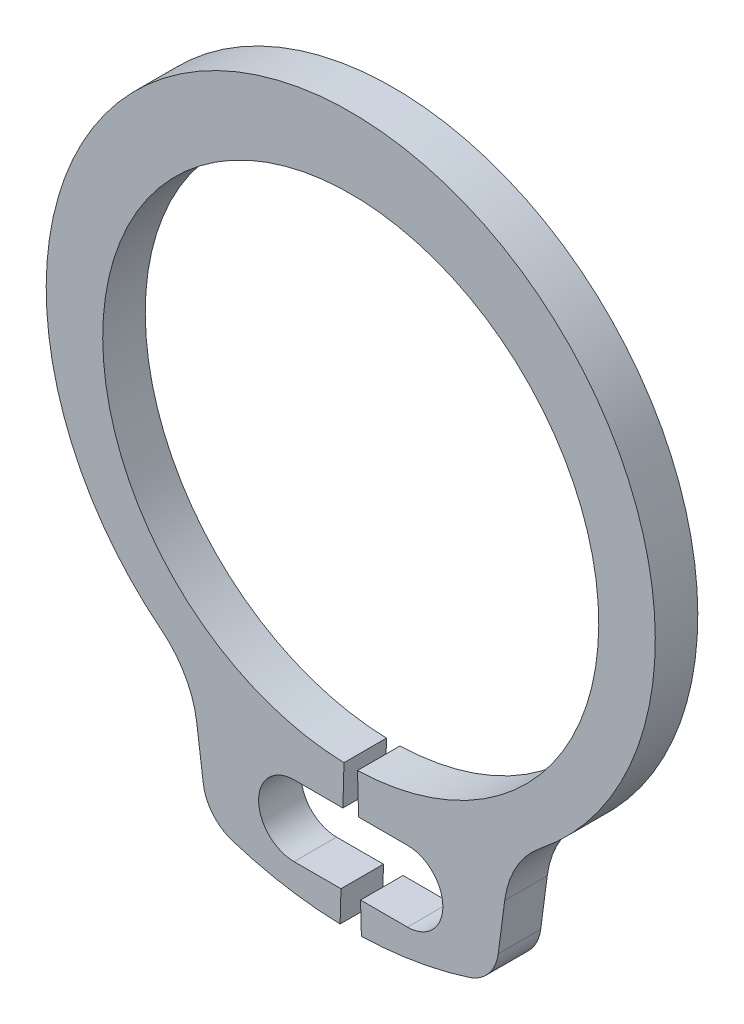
ISO-10303-21;
HEADER;
FILE_DESCRIPTION(('STEP AP214'),'2;1');
FILE_NAME('part.step','',(''),(''),'','','');
FILE_SCHEMA(('AUTOMOTIVE_DESIGN { 1 0 10303 214 1 1 1 1 }'));
ENDSEC;
DATA;
#1=APPLICATION_CONTEXT('core data for automotive mechanical design processes');
#2=APPLICATION_PROTOCOL_DEFINITION('international standard','automotive_design',2000,#1);
#3=PRODUCT_CONTEXT('',#1,'mechanical');
#4=PRODUCT('Part','Part','',(#3));
#5=PRODUCT_RELATED_PRODUCT_CATEGORY('part','',(#4));
#6=PRODUCT_DEFINITION_FORMATION('','',#4);
#7=PRODUCT_DEFINITION_CONTEXT('part definition',#1,'design');
#8=PRODUCT_DEFINITION('design','',#6,#7);
#9=PRODUCT_DEFINITION_SHAPE('','',#8);
#10=(LENGTH_UNIT() NAMED_UNIT(*) SI_UNIT(.MILLI.,.METRE.));
#11=(NAMED_UNIT(*) PLANE_ANGLE_UNIT() SI_UNIT($,.RADIAN.));
#12=(NAMED_UNIT(*) SI_UNIT($,.STERADIAN.) SOLID_ANGLE_UNIT());
#13=UNCERTAINTY_MEASURE_WITH_UNIT(LENGTH_MEASURE(1.E-05),#10,'distance_accuracy_value','');
#14=(GEOMETRIC_REPRESENTATION_CONTEXT(3) GLOBAL_UNCERTAINTY_ASSIGNED_CONTEXT((#13)) GLOBAL_UNIT_ASSIGNED_CONTEXT((#10,
#11,#12)) REPRESENTATION_CONTEXT('',''));
#15=CARTESIAN_POINT('',(0.,0.,0.));
#16=DIRECTION('',(0.,0.,1.));
#17=DIRECTION('',(1.,0.,0.));
#18=AXIS2_PLACEMENT_3D('',#15,#16,#17);
#19=CARTESIAN_POINT('',(-0.0606136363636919,-2.22167329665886,-0.381000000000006));
#20=DIRECTION('',(0.999628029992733,-0.0272727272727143,0.));
#21=DIRECTION('',(0.0272727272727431,0.999628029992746,0.));
#22=AXIS2_PLACEMENT_3D('',#19,#20,#21);
#23=PLANE('',#22);
#24=DIRECTION('',(0.,0.,1.));
#25=VECTOR('',#24,1.);
#26=CARTESIAN_POINT('',(-0.0703442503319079,-2.57832976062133,-0.381000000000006));
#27=LINE('',#26,#25);
#28=CARTESIAN_POINT('',(-0.0703442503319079,-2.57832976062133,-0.381000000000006));
#29=VERTEX_POINT('',#28);
#30=CARTESIAN_POINT('',(-0.0703442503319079,-2.57832976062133,0.));
#31=VERTEX_POINT('',#30);
#32=EDGE_CURVE('E193',#29,#31,#27,.T.);
#33=ORIENTED_EDGE('',*,*,#32,.F.);
#34=DIRECTION('',(0.027272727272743,0.999628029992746,0.));
#35=VECTOR('',#34,1.);
#36=CARTESIAN_POINT('',(-0.0606136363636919,-2.22167329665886,-0.381000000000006));
#37=LINE('',#36,#35);
#38=CARTESIAN_POINT('',(-0.0606136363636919,-2.22167329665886,-0.381000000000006));
#39=VERTEX_POINT('',#38);
#40=EDGE_CURVE('E275',#29,#39,#37,.T.);
#41=ORIENTED_EDGE('',*,*,#40,.T.);
#42=DIRECTION('',(0.,0.,1.));
#43=VECTOR('',#42,1.);
#44=CARTESIAN_POINT('',(-0.0606136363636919,-2.22167329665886,-0.381000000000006));
#45=LINE('',#44,#43);
#46=CARTESIAN_POINT('',(-0.0606136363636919,-2.22167329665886,0.));
#47=VERTEX_POINT('',#46);
#48=EDGE_CURVE('E11',#39,#47,#45,.T.);
#49=ORIENTED_EDGE('',*,*,#48,.T.);
#50=DIRECTION('',(0.027272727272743,0.999628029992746,0.));
#51=VECTOR('',#50,1.);
#52=CARTESIAN_POINT('',(-0.0606136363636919,-2.22167329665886,0.));
#53=LINE('',#52,#51);
#54=EDGE_CURVE('E239',#31,#47,#53,.T.);
#55=ORIENTED_EDGE('',*,*,#54,.F.);
#56=EDGE_LOOP('',(#33,#41,#49,#55));
#57=FACE_BOUND('',#56,.T.);
#58=ADVANCED_FACE('F26',(#57),#23,.T.);
#59=CARTESIAN_POINT('',(0.0606136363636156,-2.22167329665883,-0.381000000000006));
#60=DIRECTION('',(-0.999628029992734,-0.0272727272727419,0.));
#61=DIRECTION('',(0.0272727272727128,-0.999628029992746,0.));
#62=AXIS2_PLACEMENT_3D('',#59,#60,#61);
#63=PLANE('',#62);
#64=DIRECTION('',(0.,0.,-1.));
#65=VECTOR('',#64,1.);
#66=CARTESIAN_POINT('',(0.0703442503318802,-2.57832976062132,-0.381000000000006));
#67=LINE('',#66,#65);
#68=CARTESIAN_POINT('',(0.0703442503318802,-2.57832976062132,0.));
#69=VERTEX_POINT('',#68);
#70=CARTESIAN_POINT('',(0.0703442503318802,-2.57832976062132,-0.381000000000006));
#71=VERTEX_POINT('',#70);
#72=EDGE_CURVE('E197',#69,#71,#67,.T.);
#73=ORIENTED_EDGE('',*,*,#72,.F.);
#74=DIRECTION('',(0.0272727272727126,-0.999628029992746,0.));
#75=VECTOR('',#74,1.);
#76=CARTESIAN_POINT('',(0.0606136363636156,-2.22167329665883,0.));
#77=LINE('',#76,#75);
#78=CARTESIAN_POINT('',(0.0606136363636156,-2.22167329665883,0.));
#79=VERTEX_POINT('',#78);
#80=EDGE_CURVE('E210',#79,#69,#77,.T.);
#81=ORIENTED_EDGE('',*,*,#80,.F.);
#82=DIRECTION('',(0.,0.,1.));
#83=VECTOR('',#82,1.);
#84=CARTESIAN_POINT('',(0.0606136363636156,-2.22167329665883,-0.381000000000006));
#85=LINE('',#84,#83);
#86=CARTESIAN_POINT('',(0.0606136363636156,-2.22167329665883,-0.381000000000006));
#87=VERTEX_POINT('',#86);
#88=EDGE_CURVE('E30',#87,#79,#85,.T.);
#89=ORIENTED_EDGE('',*,*,#88,.F.);
#90=DIRECTION('',(0.0272727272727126,-0.999628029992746,0.));
#91=VECTOR('',#90,1.);
#92=CARTESIAN_POINT('',(0.0606136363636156,-2.22167329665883,-0.381000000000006));
#93=LINE('',#92,#91);
#94=EDGE_CURVE('E245',#87,#71,#93,.T.);
#95=ORIENTED_EDGE('',*,*,#94,.T.);
#96=EDGE_LOOP('',(#73,#81,#89,#95));
#97=FACE_BOUND('',#96,.T.);
#98=ADVANCED_FACE('F309',(#97),#63,.T.);
#99=CARTESIAN_POINT('',(0.,0.,-0.381000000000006));
#100=DIRECTION('',(0.,0.,1.));
#101=DIRECTION('',(1.00000000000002,0.,0.));
#102=AXIS2_PLACEMENT_3D('',#99,#100,#101);
#103=CYLINDRICAL_SURFACE('',#102,2.2225);
#104=CARTESIAN_POINT('',(0.,0.,0.));
#105=DIRECTION('',(0.,0.,-1.));
#106=DIRECTION('',(1.00000000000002,0.,0.));
#107=AXIS2_PLACEMENT_3D('',#104,#105,#106);
#108=CIRCLE('',#107,2.2225);
#109=EDGE_CURVE('E206',#47,#79,#108,.T.);
#110=ORIENTED_EDGE('',*,*,#109,.F.);
#111=ORIENTED_EDGE('',*,*,#48,.F.);
#112=CARTESIAN_POINT('',(0.,0.,-0.381000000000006));
#113=DIRECTION('',(0.,0.,-1.));
#114=DIRECTION('',(1.00000000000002,0.,0.));
#115=AXIS2_PLACEMENT_3D('',#112,#113,#114);
#116=CIRCLE('',#115,2.2225);
#117=EDGE_CURVE('E241',#39,#87,#116,.T.);
#118=ORIENTED_EDGE('',*,*,#117,.T.);
#119=ORIENTED_EDGE('',*,*,#88,.T.);
#120=EDGE_LOOP('',(#110,#111,#118,#119));
#121=FACE_BOUND('',#120,.T.);
#122=ADVANCED_FACE('F28',(#121),#103,.F.);
#123=DIRECTION('',(0.,0.,-1.));
#124=VECTOR('',#123,1.);
#125=CARTESIAN_POINT('',(-0.0876688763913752,-3.21332976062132,-0.381000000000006));
#126=LINE('',#125,#124);
#127=CARTESIAN_POINT('',(-0.0876688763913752,-3.21332976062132,0.));
#128=VERTEX_POINT('',#127);
#129=CARTESIAN_POINT('',(-0.0876688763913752,-3.21332976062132,-0.381000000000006));
#130=VERTEX_POINT('',#129);
#131=EDGE_CURVE('E331',#128,#130,#126,.T.);
#132=ORIENTED_EDGE('',*,*,#131,.F.);
#133=CARTESIAN_POINT('',(-0.0952499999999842,-3.49120089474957,0.));
#134=VERTEX_POINT('',#133);
#135=EDGE_CURVE('E187',#134,#128,#53,.T.);
#136=ORIENTED_EDGE('',*,*,#135,.F.);
#137=DIRECTION('',(0.,0.,1.));
#138=VECTOR('',#137,1.);
#139=CARTESIAN_POINT('',(-0.0952499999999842,-3.49120089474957,-0.381000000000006));
#140=LINE('',#139,#138);
#141=CARTESIAN_POINT('',(-0.0952499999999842,-3.49120089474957,-0.381000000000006));
#142=VERTEX_POINT('',#141);
#143=EDGE_CURVE('E35',#142,#134,#140,.T.);
#144=ORIENTED_EDGE('',*,*,#143,.F.);
#145=EDGE_CURVE('E276',#142,#130,#37,.T.);
#146=ORIENTED_EDGE('',*,*,#145,.T.);
#147=EDGE_LOOP('',(#132,#136,#144,#146));
#148=FACE_BOUND('',#147,.T.);
#149=ADVANCED_FACE('F340',(#148),#23,.T.);
#150=CARTESIAN_POINT('',(0.,0.,-0.381000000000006));
#151=DIRECTION('',(0.,0.,1.));
#152=DIRECTION('',(1.00000000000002,0.,0.));
#153=AXIS2_PLACEMENT_3D('',#150,#151,#152);
#154=CYLINDRICAL_SURFACE('',#153,3.4925);
#155=CARTESIAN_POINT('',(0.,0.,0.));
#156=DIRECTION('',(0.,0.,1.));
#157=DIRECTION('',(1.00000000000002,0.,0.));
#158=AXIS2_PLACEMENT_3D('',#155,#156,#157);
#159=CIRCLE('',#158,3.4925);
#160=CARTESIAN_POINT('',(-1.05894131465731,-3.3280924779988,0.));
#161=VERTEX_POINT('',#160);
#162=EDGE_CURVE('E237',#161,#134,#159,.T.);
#163=ORIENTED_EDGE('',*,*,#162,.F.);
#164=DIRECTION('',(0.,0.,1.));
#165=VECTOR('',#164,1.);
#166=CARTESIAN_POINT('',(-1.05894131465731,-3.3280924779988,-0.381000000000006));
#167=LINE('',#166,#165);
#168=CARTESIAN_POINT('',(-1.05894131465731,-3.3280924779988,-0.381000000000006));
#169=VERTEX_POINT('',#168);
#170=EDGE_CURVE('E280',#169,#161,#167,.T.);
#171=ORIENTED_EDGE('',*,*,#170,.F.);
#172=CARTESIAN_POINT('',(0.,0.,-0.381000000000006));
#173=DIRECTION('',(0.,0.,1.));
#174=DIRECTION('',(1.00000000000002,0.,0.));
#175=AXIS2_PLACEMENT_3D('',#172,#173,#174);
#176=CIRCLE('',#175,3.4925);
#177=EDGE_CURVE('E272',#169,#142,#176,.T.);
#178=ORIENTED_EDGE('',*,*,#177,.T.);
#179=ORIENTED_EDGE('',*,*,#143,.T.);
#180=EDGE_LOOP('',(#163,#171,#178,#179));
#181=FACE_BOUND('',#180,.T.);
#182=ADVANCED_FACE('F343',(#181),#154,.T.);
#183=CARTESIAN_POINT('',(-0.94342044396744,-2.96502784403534,-0.381000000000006));
#184=DIRECTION('',(0.,0.,1.));
#185=DIRECTION('',(1.00000000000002,0.,0.));
#186=AXIS2_PLACEMENT_3D('',#183,#184,#185);
#187=CYLINDRICAL_SURFACE('',#186,0.381);
#188=CARTESIAN_POINT('',(-0.94342044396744,-2.96502784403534,0.));
#189=DIRECTION('',(0.,0.,1.));
#190=DIRECTION('',(1.00000000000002,0.,0.));
#191=AXIS2_PLACEMENT_3D('',#188,#189,#190);
#192=CIRCLE('',#191,0.381);
#193=CARTESIAN_POINT('',(-1.32116093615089,-3.01475832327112,0.));
#194=VERTEX_POINT('',#193);
#195=EDGE_CURVE('E234',#194,#161,#192,.T.);
#196=ORIENTED_EDGE('',*,*,#195,.F.);
#197=DIRECTION('',(0.,0.,1.));
#198=VECTOR('',#197,1.);
#199=CARTESIAN_POINT('',(-1.32116093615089,-3.01475832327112,-0.381000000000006));
#200=LINE('',#199,#198);
#201=CARTESIAN_POINT('',(-1.32116093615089,-3.01475832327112,-0.381000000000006));
#202=VERTEX_POINT('',#201);
#203=EDGE_CURVE('E282',#202,#194,#200,.T.);
#204=ORIENTED_EDGE('',*,*,#203,.F.);
#205=CARTESIAN_POINT('',(-0.94342044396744,-2.96502784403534,-0.381000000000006));
#206=DIRECTION('',(0.,0.,1.));
#207=DIRECTION('',(1.00000000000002,0.,0.));
#208=AXIS2_PLACEMENT_3D('',#205,#206,#207);
#209=CIRCLE('',#208,0.381);
#210=EDGE_CURVE('E269',#202,#169,#209,.T.);
#211=ORIENTED_EDGE('',*,*,#210,.T.);
#212=ORIENTED_EDGE('',*,*,#170,.T.);
#213=EDGE_LOOP('',(#196,#204,#211,#212));
#214=FACE_BOUND('',#213,.T.);
#215=ADVANCED_FACE('F348',(#214),#187,.T.);
#216=CARTESIAN_POINT('',(-1.37963945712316,-2.57056985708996,-0.381000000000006));
#217=DIRECTION('',(-0.991444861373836,-0.130526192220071,0.));
#218=DIRECTION('',(0.130526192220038,-0.991444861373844,0.));
#219=AXIS2_PLACEMENT_3D('',#216,#217,#218);
#220=PLANE('',#219);
#221=DIRECTION('',(0.130526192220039,-0.991444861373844,0.));
#222=VECTOR('',#221,1.);
#223=CARTESIAN_POINT('',(-1.37963945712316,-2.57056985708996,0.));
#224=LINE('',#223,#222);
#225=CARTESIAN_POINT('',(-1.37963945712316,-2.57056985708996,0.));
#226=VERTEX_POINT('',#225);
#227=EDGE_CURVE('E231',#226,#194,#224,.T.);
#228=ORIENTED_EDGE('',*,*,#227,.F.);
#229=DIRECTION('',(0.,0.,1.));
#230=VECTOR('',#229,1.);
#231=CARTESIAN_POINT('',(-1.37963945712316,-2.57056985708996,-0.381000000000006));
#232=LINE('',#231,#230);
#233=CARTESIAN_POINT('',(-1.37963945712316,-2.57056985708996,-0.381000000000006));
#234=VERTEX_POINT('',#233);
#235=EDGE_CURVE('E284',#234,#226,#232,.T.);
#236=ORIENTED_EDGE('',*,*,#235,.F.);
#237=DIRECTION('',(0.130526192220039,-0.991444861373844,0.));
#238=VECTOR('',#237,1.);
#239=CARTESIAN_POINT('',(-1.37963945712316,-2.57056985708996,-0.381000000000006));
#240=LINE('',#239,#238);
#241=EDGE_CURVE('E266',#234,#202,#240,.T.);
#242=ORIENTED_EDGE('',*,*,#241,.T.);
#243=ORIENTED_EDGE('',*,*,#203,.T.);
#244=EDGE_LOOP('',(#228,#236,#242,#243));
#245=FACE_BOUND('',#244,.T.);
#246=ADVANCED_FACE('F351',(#245),#220,.T.);
#247=CARTESIAN_POINT('',(-2.23555537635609,-2.68325332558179,-0.381000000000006));
#248=DIRECTION('',(0.,0.,1.));
#249=DIRECTION('',(1.00000000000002,0.,0.));
#250=AXIS2_PLACEMENT_3D('',#247,#248,#249);
#251=CYLINDRICAL_SURFACE('',#250,0.863301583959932);
#252=CARTESIAN_POINT('',(-2.23555537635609,-2.68325332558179,0.));
#253=DIRECTION('',(0.,0.,-1.));
#254=DIRECTION('',(1.00000000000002,0.,0.));
#255=AXIS2_PLACEMENT_3D('',#252,#253,#254);
#256=CIRCLE('',#255,0.863301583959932);
#257=CARTESIAN_POINT('',(-1.69829563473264,-2.00750071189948,0.));
#258=VERTEX_POINT('',#257);
#259=EDGE_CURVE('E228',#258,#226,#256,.T.);
#260=ORIENTED_EDGE('',*,*,#259,.F.);
#261=DIRECTION('',(0.,0.,1.));
#262=VECTOR('',#261,1.);
#263=CARTESIAN_POINT('',(-1.69829563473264,-2.00750071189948,-0.381000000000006));
#264=LINE('',#263,#262);
#265=CARTESIAN_POINT('',(-1.69829563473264,-2.00750071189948,-0.381000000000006));
#266=VERTEX_POINT('',#265);
#267=EDGE_CURVE('E286',#266,#258,#264,.T.);
#268=ORIENTED_EDGE('',*,*,#267,.F.);
#269=CARTESIAN_POINT('',(-2.23555537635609,-2.68325332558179,-0.381000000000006));
#270=DIRECTION('',(0.,0.,-1.));
#271=DIRECTION('',(1.00000000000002,0.,0.));
#272=AXIS2_PLACEMENT_3D('',#269,#270,#271);
#273=CIRCLE('',#272,0.863301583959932);
#274=EDGE_CURVE('E263',#266,#234,#273,.T.);
#275=ORIENTED_EDGE('',*,*,#274,.T.);
#276=ORIENTED_EDGE('',*,*,#235,.T.);
#277=EDGE_LOOP('',(#260,#268,#275,#276));
#278=FACE_BOUND('',#277,.T.);
#279=ADVANCED_FACE('F356',(#278),#251,.F.);
#280=CARTESIAN_POINT('',(0.,0.128575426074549,-0.381000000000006));
#281=DIRECTION('',(0.,0.,1.));
#282=DIRECTION('',(1.00000000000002,0.,0.));
#283=AXIS2_PLACEMENT_3D('',#280,#281,#282);
#284=CYLINDRICAL_SURFACE('',#283,2.72892457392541);
#285=CARTESIAN_POINT('',(0.,0.128575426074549,0.));
#286=DIRECTION('',(0.,0.,1.));
#287=DIRECTION('',(1.00000000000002,0.,0.));
#288=AXIS2_PLACEMENT_3D('',#285,#286,#287);
#289=CIRCLE('',#288,2.72892457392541);
#290=CARTESIAN_POINT('',(1.69829563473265,-2.00750071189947,0.));
#291=VERTEX_POINT('',#290);
#292=EDGE_CURVE('E225',#291,#258,#289,.T.);
#293=ORIENTED_EDGE('',*,*,#292,.F.);
#294=DIRECTION('',(0.,0.,1.));
#295=VECTOR('',#294,1.);
#296=CARTESIAN_POINT('',(1.69829563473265,-2.00750071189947,-0.381000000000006));
#297=LINE('',#296,#295);
#298=CARTESIAN_POINT('',(1.69829563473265,-2.00750071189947,-0.381000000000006));
#299=VERTEX_POINT('',#298);
#300=EDGE_CURVE('E288',#299,#291,#297,.T.);
#301=ORIENTED_EDGE('',*,*,#300,.F.);
#302=CARTESIAN_POINT('',(0.,0.128575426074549,-0.381000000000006));
#303=DIRECTION('',(0.,0.,1.));
#304=DIRECTION('',(1.00000000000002,0.,0.));
#305=AXIS2_PLACEMENT_3D('',#302,#303,#304);
#306=CIRCLE('',#305,2.72892457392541);
#307=EDGE_CURVE('E260',#299,#266,#306,.T.);
#308=ORIENTED_EDGE('',*,*,#307,.T.);
#309=ORIENTED_EDGE('',*,*,#267,.T.);
#310=EDGE_LOOP('',(#293,#301,#308,#309));
#311=FACE_BOUND('',#310,.T.);
#312=ADVANCED_FACE('F359',(#311),#284,.T.);
#313=CARTESIAN_POINT('',(2.23555537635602,-2.6832533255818,-0.381000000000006));
#314=DIRECTION('',(0.,0.,1.));
#315=DIRECTION('',(1.00000000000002,0.,0.));
#316=AXIS2_PLACEMENT_3D('',#313,#314,#315);
#317=CYLINDRICAL_SURFACE('',#316,0.863301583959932);
#318=CARTESIAN_POINT('',(2.23555537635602,-2.6832533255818,0.));
#319=DIRECTION('',(0.,0.,-1.));
#320=DIRECTION('',(1.00000000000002,0.,0.));
#321=AXIS2_PLACEMENT_3D('',#318,#319,#320);
#322=CIRCLE('',#321,0.863301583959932);
#323=CARTESIAN_POINT('',(1.37963945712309,-2.57056985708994,0.));
#324=VERTEX_POINT('',#323);
#325=EDGE_CURVE('E222',#324,#291,#322,.T.);
#326=ORIENTED_EDGE('',*,*,#325,.F.);
#327=DIRECTION('',(0.,0.,1.));
#328=VECTOR('',#327,1.);
#329=CARTESIAN_POINT('',(1.37963945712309,-2.57056985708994,-0.381000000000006));
#330=LINE('',#329,#328);
#331=CARTESIAN_POINT('',(1.37963945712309,-2.57056985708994,-0.381000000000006));
#332=VERTEX_POINT('',#331);
#333=EDGE_CURVE('E290',#332,#324,#330,.T.);
#334=ORIENTED_EDGE('',*,*,#333,.F.);
#335=CARTESIAN_POINT('',(2.23555537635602,-2.6832533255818,-0.381000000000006));
#336=DIRECTION('',(0.,0.,-1.));
#337=DIRECTION('',(1.00000000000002,0.,0.));
#338=AXIS2_PLACEMENT_3D('',#335,#336,#337);
#339=CIRCLE('',#338,0.863301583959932);
#340=EDGE_CURVE('E257',#332,#299,#339,.T.);
#341=ORIENTED_EDGE('',*,*,#340,.T.);
#342=ORIENTED_EDGE('',*,*,#300,.T.);
#343=EDGE_LOOP('',(#326,#334,#341,#342));
#344=FACE_BOUND('',#343,.T.);
#345=ADVANCED_FACE('F364',(#344),#317,.F.);
#346=CARTESIAN_POINT('',(1.37963945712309,-2.57056985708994,-0.381000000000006));
#347=DIRECTION('',(0.991444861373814,-0.13052619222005,0.));
#348=DIRECTION('',(0.130526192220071,0.991444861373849,0.));
#349=AXIS2_PLACEMENT_3D('',#346,#347,#348);
#350=PLANE('',#349);
#351=DIRECTION('',(0.130526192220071,0.991444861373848,0.));
#352=VECTOR('',#351,1.);
#353=CARTESIAN_POINT('',(1.37963945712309,-2.57056985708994,0.));
#354=LINE('',#353,#352);
#355=CARTESIAN_POINT('',(1.32116093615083,-3.01475832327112,0.));
#356=VERTEX_POINT('',#355);
#357=EDGE_CURVE('E219',#356,#324,#354,.T.);
#358=ORIENTED_EDGE('',*,*,#357,.F.);
#359=DIRECTION('',(0.,0.,1.));
#360=VECTOR('',#359,1.);
#361=CARTESIAN_POINT('',(1.32116093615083,-3.01475832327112,-0.381000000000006));
#362=LINE('',#361,#360);
#363=CARTESIAN_POINT('',(1.32116093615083,-3.01475832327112,-0.381000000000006));
#364=VERTEX_POINT('',#363);
#365=EDGE_CURVE('E292',#364,#356,#362,.T.);
#366=ORIENTED_EDGE('',*,*,#365,.F.);
#367=DIRECTION('',(0.130526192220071,0.991444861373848,0.));
#368=VECTOR('',#367,1.);
#369=CARTESIAN_POINT('',(1.37963945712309,-2.57056985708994,-0.381000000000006));
#370=LINE('',#369,#368);
#371=EDGE_CURVE('E254',#364,#332,#370,.T.);
#372=ORIENTED_EDGE('',*,*,#371,.T.);
#373=ORIENTED_EDGE('',*,*,#333,.T.);
#374=EDGE_LOOP('',(#358,#366,#372,#373));
#375=FACE_BOUND('',#374,.T.);
#376=ADVANCED_FACE('F367',(#375),#350,.T.);
#377=CARTESIAN_POINT('',(0.94342044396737,-2.96502784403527,-0.381000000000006));
#378=DIRECTION('',(0.,0.,1.));
#379=DIRECTION('',(1.00000000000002,0.,0.));
#380=AXIS2_PLACEMENT_3D('',#377,#378,#379);
#381=CYLINDRICAL_SURFACE('',#380,0.381);
#382=CARTESIAN_POINT('',(0.94342044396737,-2.96502784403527,0.));
#383=DIRECTION('',(0.,0.,1.));
#384=DIRECTION('',(-1.00000000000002,0.,0.));
#385=AXIS2_PLACEMENT_3D('',#382,#383,#384);
#386=CIRCLE('',#385,0.381);
#387=CARTESIAN_POINT('',(1.05894131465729,-3.32809247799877,0.));
#388=VERTEX_POINT('',#387);
#389=EDGE_CURVE('E216',#388,#356,#386,.T.);
#390=ORIENTED_EDGE('',*,*,#389,.F.);
#391=DIRECTION('',(0.,0.,1.));
#392=VECTOR('',#391,1.);
#393=CARTESIAN_POINT('',(1.05894131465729,-3.32809247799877,-0.381000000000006));
#394=LINE('',#393,#392);
#395=CARTESIAN_POINT('',(1.05894131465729,-3.32809247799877,-0.381000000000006));
#396=VERTEX_POINT('',#395);
#397=EDGE_CURVE('E294',#396,#388,#394,.T.);
#398=ORIENTED_EDGE('',*,*,#397,.F.);
#399=CARTESIAN_POINT('',(0.94342044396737,-2.96502784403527,-0.381000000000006));
#400=DIRECTION('',(0.,0.,1.));
#401=DIRECTION('',(-1.00000000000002,0.,0.));
#402=AXIS2_PLACEMENT_3D('',#399,#400,#401);
#403=CIRCLE('',#402,0.381);
#404=EDGE_CURVE('E251',#396,#364,#403,.T.);
#405=ORIENTED_EDGE('',*,*,#404,.T.);
#406=ORIENTED_EDGE('',*,*,#365,.T.);
#407=EDGE_LOOP('',(#390,#398,#405,#406));
#408=FACE_BOUND('',#407,.T.);
#409=ADVANCED_FACE('F372',(#408),#381,.T.);
#410=CARTESIAN_POINT('',(0.,0.,-0.381000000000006));
#411=DIRECTION('',(0.,0.,1.));
#412=DIRECTION('',(1.00000000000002,0.,0.));
#413=AXIS2_PLACEMENT_3D('',#410,#411,#412);
#414=CYLINDRICAL_SURFACE('',#413,3.4925);
#415=CARTESIAN_POINT('',(0.,0.,0.));
#416=DIRECTION('',(0.,0.,1.));
#417=DIRECTION('',(1.00000000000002,0.,0.));
#418=AXIS2_PLACEMENT_3D('',#415,#416,#417);
#419=CIRCLE('',#418,3.4925);
#420=CARTESIAN_POINT('',(0.0952500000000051,-3.49120089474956,0.));
#421=VERTEX_POINT('',#420);
#422=EDGE_CURVE('E213',#421,#388,#419,.T.);
#423=ORIENTED_EDGE('',*,*,#422,.F.);
#424=DIRECTION('',(0.,0.,1.));
#425=VECTOR('',#424,1.);
#426=CARTESIAN_POINT('',(0.0952500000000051,-3.49120089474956,-0.381000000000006));
#427=LINE('',#426,#425);
#428=CARTESIAN_POINT('',(0.0952500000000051,-3.49120089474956,-0.381000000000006));
#429=VERTEX_POINT('',#428);
#430=EDGE_CURVE('E295',#429,#421,#427,.T.);
#431=ORIENTED_EDGE('',*,*,#430,.F.);
#432=CARTESIAN_POINT('',(0.,0.,-0.381000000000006));
#433=DIRECTION('',(0.,0.,1.));
#434=DIRECTION('',(1.00000000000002,0.,0.));
#435=AXIS2_PLACEMENT_3D('',#432,#433,#434);
#436=CIRCLE('',#435,3.4925);
#437=EDGE_CURVE('E248',#429,#396,#436,.T.);
#438=ORIENTED_EDGE('',*,*,#437,.T.);
#439=ORIENTED_EDGE('',*,*,#397,.T.);
#440=EDGE_LOOP('',(#423,#431,#438,#439));
#441=FACE_BOUND('',#440,.T.);
#442=ADVANCED_FACE('F374',(#441),#414,.T.);
#443=DIRECTION('',(0.,0.,1.));
#444=VECTOR('',#443,1.);
#445=CARTESIAN_POINT('',(0.0876688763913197,-3.21332976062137,-0.381000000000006));
#446=LINE('',#445,#444);
#447=CARTESIAN_POINT('',(0.0876688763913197,-3.21332976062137,-0.381000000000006));
#448=VERTEX_POINT('',#447);
#449=CARTESIAN_POINT('',(0.0876688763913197,-3.21332976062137,0.));
#450=VERTEX_POINT('',#449);
#451=EDGE_CURVE('E327',#448,#450,#446,.T.);
#452=ORIENTED_EDGE('',*,*,#451,.F.);
#453=EDGE_CURVE('E244',#448,#429,#93,.T.);
#454=ORIENTED_EDGE('',*,*,#453,.T.);
#455=ORIENTED_EDGE('',*,*,#430,.T.);
#456=EDGE_CURVE('E209',#450,#421,#77,.T.);
#457=ORIENTED_EDGE('',*,*,#456,.F.);
#458=EDGE_LOOP('',(#452,#454,#455,#457));
#459=FACE_BOUND('',#458,.T.);
#460=ADVANCED_FACE('F377',(#459),#63,.T.);
#461=CARTESIAN_POINT('',(0.,0.,-0.381000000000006));
#462=DIRECTION('',(0.,0.,1.));
#463=DIRECTION('',(1.00000000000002,0.,0.));
#464=AXIS2_PLACEMENT_3D('',#461,#462,#463);
#465=PLANE('',#464);
#466=CARTESIAN_POINT('',(0.507999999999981,-2.89582976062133,-0.381000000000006));
#467=DIRECTION('',(0.,0.,1.));
#468=DIRECTION('',(1.00000000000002,0.,0.));
#469=AXIS2_PLACEMENT_3D('',#466,#467,#468);
#470=CIRCLE('',#469,0.3175);
#471=CARTESIAN_POINT('',(0.50799999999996,-3.21332976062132,-0.381000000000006));
#472=VERTEX_POINT('',#471);
#473=CARTESIAN_POINT('',(0.507999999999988,-2.57832976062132,-0.381000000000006));
#474=VERTEX_POINT('',#473);
#475=EDGE_CURVE('E203',#472,#474,#470,.T.);
#476=ORIENTED_EDGE('',*,*,#475,.T.);
#477=DIRECTION('',(-1.00000000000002,0.,0.));
#478=VECTOR('',#477,1.);
#479=CARTESIAN_POINT('',(-0.508000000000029,-2.57832976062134,-0.381000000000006));
#480=LINE('',#479,#478);
#481=EDGE_CURVE('E51',#474,#71,#480,.T.);
#482=ORIENTED_EDGE('',*,*,#481,.T.);
#483=ORIENTED_EDGE('',*,*,#94,.F.);
#484=ORIENTED_EDGE('',*,*,#117,.F.);
#485=ORIENTED_EDGE('',*,*,#40,.F.);
#486=CARTESIAN_POINT('',(-0.508000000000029,-2.57832976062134,-0.381000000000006));
#487=VERTEX_POINT('',#486);
#488=EDGE_CURVE('E188',#29,#487,#480,.T.);
#489=ORIENTED_EDGE('',*,*,#488,.T.);
#490=CARTESIAN_POINT('',(-0.508000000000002,-2.89582976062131,-0.381000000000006));
#491=DIRECTION('',(0.,0.,1.));
#492=DIRECTION('',(1.00000000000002,0.,0.));
#493=AXIS2_PLACEMENT_3D('',#490,#491,#492);
#494=CIRCLE('',#493,0.3175);
#495=CARTESIAN_POINT('',(-0.507999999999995,-3.21332976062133,-0.381000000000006));
#496=VERTEX_POINT('',#495);
#497=EDGE_CURVE('E192',#487,#496,#494,.T.);
#498=ORIENTED_EDGE('',*,*,#497,.T.);
#499=DIRECTION('',(1.00000000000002,0.,0.));
#500=VECTOR('',#499,1.);
#501=CARTESIAN_POINT('',(0.50799999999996,-3.21332976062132,-0.381000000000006));
#502=LINE('',#501,#500);
#503=EDGE_CURVE('E170',#496,#130,#502,.T.);
#504=ORIENTED_EDGE('',*,*,#503,.T.);
#505=ORIENTED_EDGE('',*,*,#145,.F.);
#506=ORIENTED_EDGE('',*,*,#177,.F.);
#507=ORIENTED_EDGE('',*,*,#210,.F.);
#508=ORIENTED_EDGE('',*,*,#241,.F.);
#509=ORIENTED_EDGE('',*,*,#274,.F.);
#510=ORIENTED_EDGE('',*,*,#307,.F.);
#511=ORIENTED_EDGE('',*,*,#340,.F.);
#512=ORIENTED_EDGE('',*,*,#371,.F.);
#513=ORIENTED_EDGE('',*,*,#404,.F.);
#514=ORIENTED_EDGE('',*,*,#437,.F.);
#515=ORIENTED_EDGE('',*,*,#453,.F.);
#516=EDGE_CURVE('E320',#448,#472,#502,.T.);
#517=ORIENTED_EDGE('',*,*,#516,.T.);
#518=EDGE_LOOP('',(#476,#482,#483,#484,#485,#489,#498,#504,#505,#506,#507,#508,#509,#510,#511,
#512,#513,#514,#515,#517));
#519=FACE_BOUND('',#518,.T.);
#520=ADVANCED_FACE('F316',(#519),#465,.F.);
#521=CARTESIAN_POINT('',(0.,0.,0.));
#522=DIRECTION('',(0.,0.,1.));
#523=DIRECTION('',(1.00000000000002,0.,0.));
#524=AXIS2_PLACEMENT_3D('',#521,#522,#523);
#525=PLANE('',#524);
#526=DIRECTION('',(-1.00000000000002,0.,0.));
#527=VECTOR('',#526,1.);
#528=CARTESIAN_POINT('',(-0.508000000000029,-2.57832976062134,0.));
#529=LINE('',#528,#527);
#530=CARTESIAN_POINT('',(0.507999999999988,-2.57832976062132,0.));
#531=VERTEX_POINT('',#530);
#532=EDGE_CURVE('E333',#531,#69,#529,.T.);
#533=ORIENTED_EDGE('',*,*,#532,.F.);
#534=CARTESIAN_POINT('',(0.507999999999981,-2.89582976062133,0.));
#535=DIRECTION('',(0.,0.,1.));
#536=DIRECTION('',(1.00000000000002,0.,0.));
#537=AXIS2_PLACEMENT_3D('',#534,#535,#536);
#538=CIRCLE('',#537,0.3175);
#539=CARTESIAN_POINT('',(0.50799999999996,-3.21332976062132,0.));
#540=VERTEX_POINT('',#539);
#541=EDGE_CURVE('E195',#540,#531,#538,.T.);
#542=ORIENTED_EDGE('',*,*,#541,.F.);
#543=DIRECTION('',(1.00000000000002,0.,0.));
#544=VECTOR('',#543,1.);
#545=CARTESIAN_POINT('',(0.50799999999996,-3.21332976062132,0.));
#546=LINE('',#545,#544);
#547=EDGE_CURVE('E43',#450,#540,#546,.T.);
#548=ORIENTED_EDGE('',*,*,#547,.F.);
#549=ORIENTED_EDGE('',*,*,#456,.T.);
#550=ORIENTED_EDGE('',*,*,#422,.T.);
#551=ORIENTED_EDGE('',*,*,#389,.T.);
#552=ORIENTED_EDGE('',*,*,#357,.T.);
#553=ORIENTED_EDGE('',*,*,#325,.T.);
#554=ORIENTED_EDGE('',*,*,#292,.T.);
#555=ORIENTED_EDGE('',*,*,#259,.T.);
#556=ORIENTED_EDGE('',*,*,#227,.T.);
#557=ORIENTED_EDGE('',*,*,#195,.T.);
#558=ORIENTED_EDGE('',*,*,#162,.T.);
#559=ORIENTED_EDGE('',*,*,#135,.T.);
#560=CARTESIAN_POINT('',(-0.507999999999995,-3.21332976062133,0.));
#561=VERTEX_POINT('',#560);
#562=EDGE_CURVE('E167',#561,#128,#546,.T.);
#563=ORIENTED_EDGE('',*,*,#562,.F.);
#564=CARTESIAN_POINT('',(-0.508000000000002,-2.89582976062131,0.));
#565=DIRECTION('',(0.,0.,1.));
#566=DIRECTION('',(1.00000000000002,0.,0.));
#567=AXIS2_PLACEMENT_3D('',#564,#565,#566);
#568=CIRCLE('',#567,0.3175);
#569=CARTESIAN_POINT('',(-0.508000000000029,-2.57832976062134,0.));
#570=VERTEX_POINT('',#569);
#571=EDGE_CURVE('E184',#570,#561,#568,.T.);
#572=ORIENTED_EDGE('',*,*,#571,.F.);
#573=EDGE_CURVE('E311',#31,#570,#529,.T.);
#574=ORIENTED_EDGE('',*,*,#573,.F.);
#575=ORIENTED_EDGE('',*,*,#54,.T.);
#576=ORIENTED_EDGE('',*,*,#109,.T.);
#577=ORIENTED_EDGE('',*,*,#80,.T.);
#578=EDGE_LOOP('',(#533,#542,#548,#549,#550,#551,#552,#553,#554,#555,#556,#557,#558,#559,#563,
#572,#574,#575,#576,#577));
#579=FACE_BOUND('',#578,.T.);
#580=ADVANCED_FACE('F182',(#579),#525,.T.);
#581=CARTESIAN_POINT('',(0.507999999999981,-2.89582976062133,-0.381000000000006));
#582=DIRECTION('',(0.,0.,1.));
#583=DIRECTION('',(1.00000000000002,0.,0.));
#584=AXIS2_PLACEMENT_3D('',#581,#582,#583);
#585=CYLINDRICAL_SURFACE('',#584,0.3175);
#586=ORIENTED_EDGE('',*,*,#541,.T.);
#587=DIRECTION('',(0.,0.,1.));
#588=VECTOR('',#587,1.);
#589=CARTESIAN_POINT('',(0.507999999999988,-2.57832976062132,-0.381000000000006));
#590=LINE('',#589,#588);
#591=EDGE_CURVE('E325',#474,#531,#590,.T.);
#592=ORIENTED_EDGE('',*,*,#591,.F.);
#593=ORIENTED_EDGE('',*,*,#475,.F.);
#594=DIRECTION('',(0.,0.,1.));
#595=VECTOR('',#594,1.);
#596=CARTESIAN_POINT('',(0.50799999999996,-3.21332976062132,-0.381000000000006));
#597=LINE('',#596,#595);
#598=EDGE_CURVE('E175',#472,#540,#597,.T.);
#599=ORIENTED_EDGE('',*,*,#598,.T.);
#600=EDGE_LOOP('',(#586,#592,#593,#599));
#601=FACE_BOUND('',#600,.T.);
#602=ADVANCED_FACE('F380',(#601),#585,.F.);
#603=CARTESIAN_POINT('',(-0.508000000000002,-2.89582976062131,-0.381000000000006));
#604=DIRECTION('',(0.,0.,1.));
#605=DIRECTION('',(1.00000000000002,0.,0.));
#606=AXIS2_PLACEMENT_3D('',#603,#604,#605);
#607=CYLINDRICAL_SURFACE('',#606,0.3175);
#608=ORIENTED_EDGE('',*,*,#571,.T.);
#609=DIRECTION('',(0.,0.,1.));
#610=VECTOR('',#609,1.);
#611=CARTESIAN_POINT('',(-0.507999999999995,-3.21332976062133,-0.381000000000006));
#612=LINE('',#611,#610);
#613=EDGE_CURVE('E164',#496,#561,#612,.T.);
#614=ORIENTED_EDGE('',*,*,#613,.F.);
#615=ORIENTED_EDGE('',*,*,#497,.F.);
#616=DIRECTION('',(0.,0.,1.));
#617=VECTOR('',#616,1.);
#618=CARTESIAN_POINT('',(-0.508000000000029,-2.57832976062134,-0.381000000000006));
#619=LINE('',#618,#617);
#620=EDGE_CURVE('E176',#487,#570,#619,.T.);
#621=ORIENTED_EDGE('',*,*,#620,.T.);
#622=EDGE_LOOP('',(#608,#614,#615,#621));
#623=FACE_BOUND('',#622,.T.);
#624=ADVANCED_FACE('F191',(#623),#607,.F.);
#625=CARTESIAN_POINT('',(-0.508000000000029,-2.57832976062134,-0.381000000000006));
#626=DIRECTION('',(0.,1.00000000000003,0.));
#627=DIRECTION('',(0.,0.,1.));
#628=AXIS2_PLACEMENT_3D('',#625,#626,#627);
#629=PLANE('',#628);
#630=ORIENTED_EDGE('',*,*,#32,.T.);
#631=ORIENTED_EDGE('',*,*,#573,.T.);
#632=ORIENTED_EDGE('',*,*,#620,.F.);
#633=ORIENTED_EDGE('',*,*,#488,.F.);
#634=EDGE_LOOP('',(#630,#631,#632,#633));
#635=FACE_BOUND('',#634,.T.);
#636=ADVANCED_FACE('F336',(#635),#629,.F.);
#637=CARTESIAN_POINT('',(0.50799999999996,-3.21332976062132,-0.381000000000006));
#638=DIRECTION('',(0.,-1.00000000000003,0.));
#639=DIRECTION('',(0.,0.,-1.));
#640=AXIS2_PLACEMENT_3D('',#637,#638,#639);
#641=PLANE('',#640);
#642=ORIENTED_EDGE('',*,*,#131,.T.);
#643=ORIENTED_EDGE('',*,*,#503,.F.);
#644=ORIENTED_EDGE('',*,*,#613,.T.);
#645=ORIENTED_EDGE('',*,*,#562,.T.);
#646=EDGE_LOOP('',(#642,#643,#644,#645));
#647=FACE_BOUND('',#646,.T.);
#648=ADVANCED_FACE('F166',(#647),#641,.F.);
#649=ORIENTED_EDGE('',*,*,#451,.T.);
#650=ORIENTED_EDGE('',*,*,#547,.T.);
#651=ORIENTED_EDGE('',*,*,#598,.F.);
#652=ORIENTED_EDGE('',*,*,#516,.F.);
#653=EDGE_LOOP('',(#649,#650,#651,#652));
#654=FACE_BOUND('',#653,.T.);
#655=ADVANCED_FACE('F378',(#654),#641,.F.);
#656=ORIENTED_EDGE('',*,*,#72,.T.);
#657=ORIENTED_EDGE('',*,*,#481,.F.);
#658=ORIENTED_EDGE('',*,*,#591,.T.);
#659=ORIENTED_EDGE('',*,*,#532,.T.);
#660=EDGE_LOOP('',(#656,#657,#658,#659));
#661=FACE_BOUND('',#660,.T.);
#662=ADVANCED_FACE('F332',(#661),#629,.F.);
#663=CLOSED_SHELL('',(#58,#98,#122,#149,#182,#215,#246,#279,#312,#345,#376,#409,#442,#460,#520,
#580,#602,#624,#636,#648,#655,#662));
#664=MANIFOLD_SOLID_BREP('B2',#663);
#665=ADVANCED_BREP_SHAPE_REPRESENTATION('',(#18,#664),#14);
#666=SHAPE_DEFINITION_REPRESENTATION(#9,#665);
ENDSEC;
END-ISO-10303-21;
